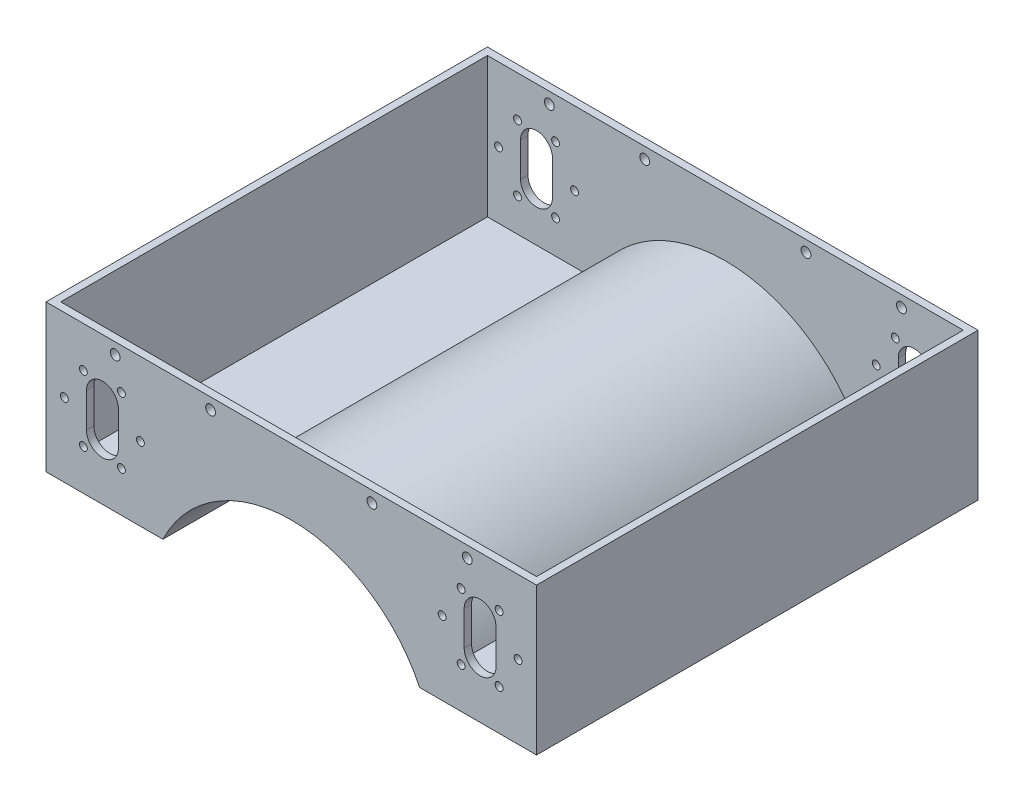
from build123d import *

# Parameters (mm, degrees)
SKETCH_2_W               = 200
SKETCH_2_H               = 180
EXTRUDE_1_DEPTH          = 60
SKETCH_6_R               = 58
CUT_EXTRUDE_2_DEPTH      = 1000
SHELL_1_T                = -3
SKETCH_10_R              = 1.6
CUT_EXTRUDE_5_DEPTH      = 1000
SKETCH_11_R              = 2
CUT_EXTRUDE_6_DEPTH      = 10
MIRROR_2_COPY_1_SKETCH_R = 2
MIRROR_2_COPY_1_DEPTH    = 10


with BuildPart() as part:
    # Sketch 2 → Extrude 1 (new body)
    with BuildSketch(Plane(origin=(0, 0, 0), x_dir=(1, 0, 0), z_dir=(0, 1, 0))):
        Rectangle(SKETCH_2_W, SKETCH_2_H)
    extrude(amount=EXTRUDE_1_DEPTH)

    # Sketch 6 → Cut-Extrude 2 (cut)
    with BuildSketch(Plane.XY.offset(90)):
        with Locations((0, -25)):
            Circle(SKETCH_6_R)
    extrude(amount=-CUT_EXTRUDE_2_DEPTH, mode=Mode.SUBTRACT)

    # Shell 1
    shell_1_openings = [part.faces().sort_by_distance(p)[0] for p in [
        (0, 60, 0),
    ]]
    offset(amount=SHELL_1_T, openings=shell_1_openings, kind=Kind.INTERSECTION)

    # Sketch 10 → Cut-Extrude 5 (cut)
    with BuildSketch(Plane.XY.offset(90)):
        with Locations((-84.75, 43.423393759)):
            Circle(SKETCH_10_R)
        with Locations((-69.25, 43.423393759)):
            Circle(SKETCH_10_R)
        with Locations((-61.5, 30)):
            Circle(SKETCH_10_R)
        with Locations((-69.25, 16.576606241)):
            Circle(SKETCH_10_R)
        with Locations((-84.75, 16.576606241)):
            Circle(SKETCH_10_R)
        with Locations((-92.5, 30)):
            Circle(SKETCH_10_R)
        with Locations(Location((92.5, 30, 0), (0, 0, 180))):
            Circle(SKETCH_10_R)
        with Locations(Location((84.75, 16.576606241, 0), (0, 0, 180))):
            Circle(SKETCH_10_R)
        with Locations(Location((69.25, 16.576606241, 0), (0, 0, 180))):
            Circle(SKETCH_10_R)
        with Locations(Location((61.5, 30, 0), (0, 0, 180))):
            Circle(SKETCH_10_R)
        with Locations(Location((69.25, 43.423393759, 0), (0, 0, 180))):
            Circle(SKETCH_10_R)
        with Locations(Location((84.75, 43.423393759, 0), (0, 0, 180))):
            Circle(SKETCH_10_R)
        with BuildLine():
            Line((-83.5, 37), (-83.5, 23))
            ThreePointArc((-83.5, 23), (-76.999800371, 16.500000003), (-70.500000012, 23.000399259))
            Line((-70.500000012, 23.000399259), (-70.500087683, 36.966238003))
            ThreePointArc((-70.500087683, 36.966238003), (-76.983118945, 43.499978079), (-83.5, 37))
        make_face()
        with BuildLine():
            Line((70.500087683, 36.966238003), (70.500000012, 23.000399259))
            ThreePointArc((70.500000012, 23.000399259), (76.999800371, 16.500000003), (83.5, 23))
            Line((83.5, 23), (83.5, 37))
            ThreePointArc((83.5, 37), (76.983118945, 43.499978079), (70.500087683, 36.966238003))
        make_face()
    extrude(amount=-CUT_EXTRUDE_5_DEPTH, mode=Mode.SUBTRACT)

    # Sketch 11 → Cut-Extrude 6 (cut)
    with BuildSketch(Plane.XY.offset(90)):
        with Locations((-71.793458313, 55.415575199)):
            Circle(SKETCH_11_R)
        with Locations((-32.883189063, 55.415575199)):
            Circle(SKETCH_11_R)
    cut_extrude_6 = extrude(amount=-CUT_EXTRUDE_6_DEPTH, mode=Mode.SUBTRACT)

    # Mirror 1: Cut-Extrude 6 across plane
    add(cut_extrude_6.mirror(Plane(origin=(0, 0, 0), x_dir=(0, 0, 1), z_dir=(1, 0, 0))), mode=Mode.SUBTRACT)

    # Mirror 2: Cut-Extrude 6 across plane
    add(cut_extrude_6.mirror(Plane.XY), mode=Mode.SUBTRACT)

    # Mirror 2 copy 1 sketch → Mirror 2 copy 1 (cut)
    with BuildSketch(Plane(origin=(0, 0, -90), x_dir=(-1, 0, 0), z_dir=(0, 0, -1))):
        with Locations((-71.793458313, 55.415575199)):
            Circle(MIRROR_2_COPY_1_SKETCH_R)
        with Locations((-32.883189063, 55.415575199)):
            Circle(MIRROR_2_COPY_1_SKETCH_R)
    extrude(amount=-MIRROR_2_COPY_1_DEPTH, mode=Mode.SUBTRACT)


solid = part.part
